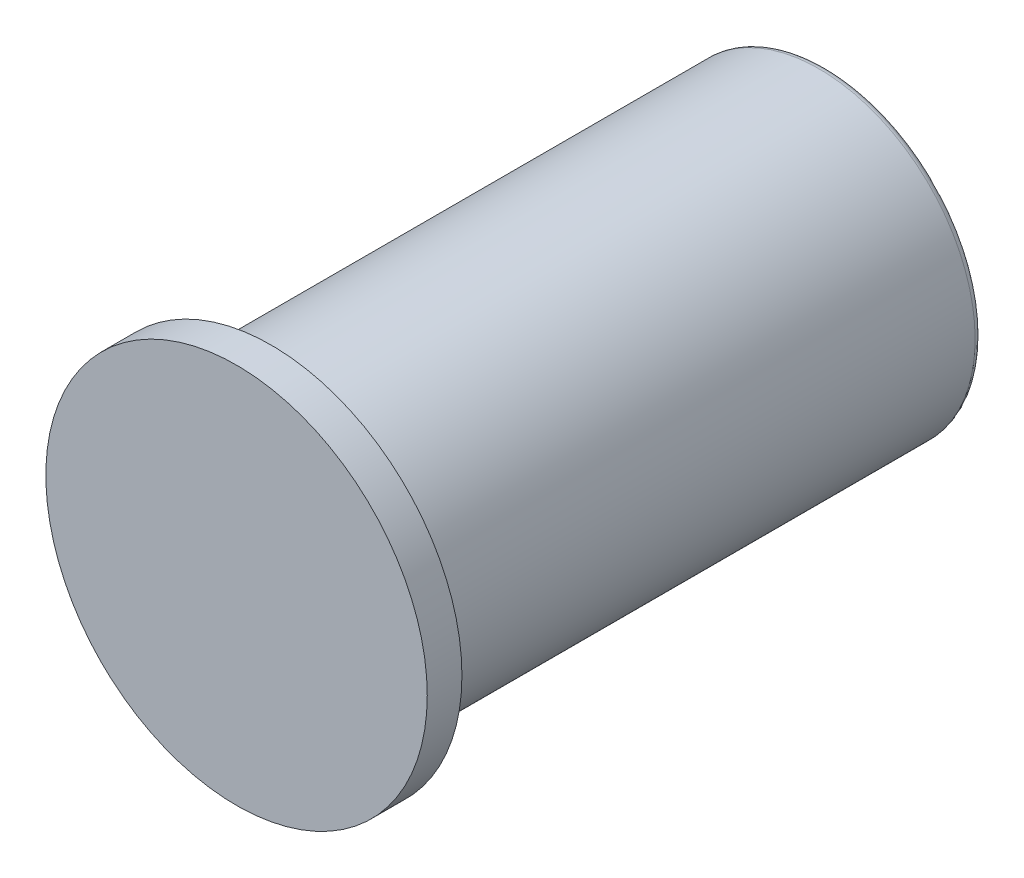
from build123d import *

# Parameters (mm, degrees)
M8_TAPPED_HOLE1_D           = 6.8
M8_TAPPED_HOLE1_DEPTH       = 19.75
M8_TAPPED_HOLE1_CSINK_D     = 9
M8_TAPPED_HOLE1_CSINK_ANGLE = 90
M8_TAPPED_HOLE1_TIP         = 2.042926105


with BuildPart() as part:
    # Sketch1 → Revolve1 (revolve)
    with BuildSketch(Plane(origin=(0, 0, 0), x_dir=(0, 0, -1), z_dir=(1, 0, 0)), mode=Mode.PRIVATE) as revolve1_sk:
        with BuildLine():
            Line((170, 0), (170, 43))
            ThreePointArc((170, 43), (169.414213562, 44.414213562), (168, 45))
            Line((168, 45), (10, 45))
            Line((10, 45), (10, 55))
            Line((10, 55), (0, 55))
            Line((0, 55), (0, 0))
            Line((0, 0), (170, 0))
        make_face()
    revolve(revolve1_sk.sketch.rotate(Axis((0, 0, 0), (0, 0, -1)), 90), axis=Axis((0, 0, 0), (0, 0, -1)))

    # M8 Tapped Hole1
    with Locations(Plane(origin=(0, 0, -170), x_dir=(-1, 0, 0), z_dir=(0, 0, -1))):
        with Locations((0, 0)):
            CounterSinkHole(M8_TAPPED_HOLE1_D / 2, M8_TAPPED_HOLE1_CSINK_D / 2, depth=M8_TAPPED_HOLE1_DEPTH, counter_sink_angle=M8_TAPPED_HOLE1_CSINK_ANGLE)
            with Locations((0, 0, -(M8_TAPPED_HOLE1_DEPTH + M8_TAPPED_HOLE1_TIP / 2))):  # 118° drill point
                Cone(0, M8_TAPPED_HOLE1_D / 2, M8_TAPPED_HOLE1_TIP, mode=Mode.SUBTRACT)


solid = part.part
